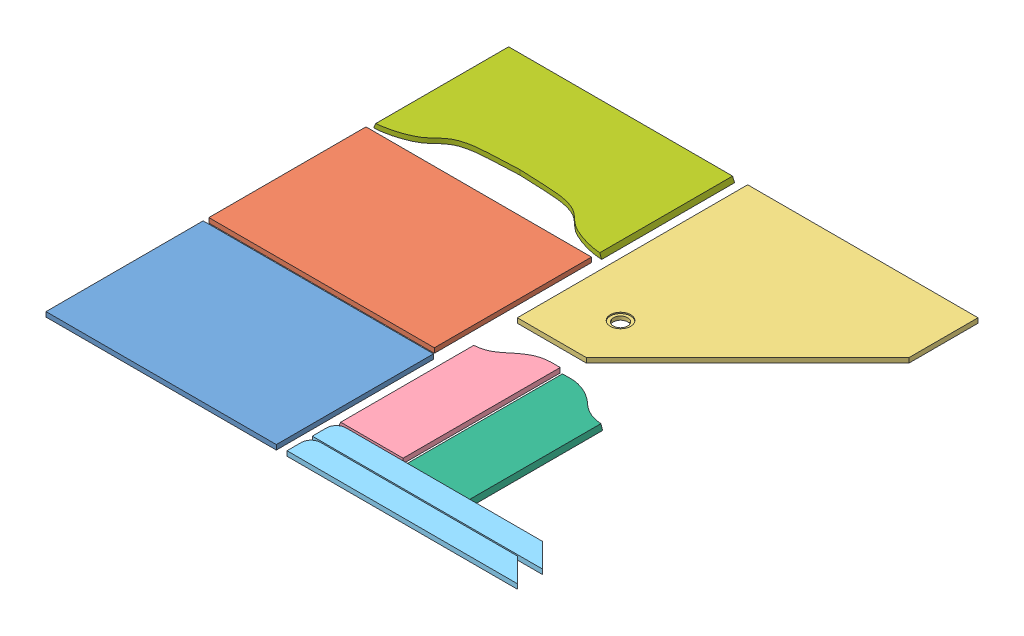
SolidWorks assembly Acrylic Layout.SLDASM, configuration Default (file format 10000). Lengths in mm.
Overall size (2502.34 1221.31 2438.4).
8 component instances, 7 part files, 19 mates.
Components (placement in the parent):
- 1-1: 1.sldprt [Default] at (1219.2 -25.4 -831.85) x (0 1 0) z (1 0 0) size (25.4 831.85 1219.2)
- 2-1: 2.sldprt [Default] at (-25.4 -1219.2 -1693.7836) x (1 0 0) z (0 -1 0) size (1193.8 831.85 25.4)
- 3-1: 3.sldprt [Default] at (1275.7043 0 -1219.2) size (1219.2 25.4 1219.2)
- 6-1: 6.sldprt [Default] at (1642.5311 -25.4 -272.8705) x (-1 0 0) z (0 -1 0) size (340.72 831.85 25.4)
- 7-1: 7.sldprt [Default] at (2494.9043 -857.25 -1352.9888) x (-1 0 0) z (0 0 -1) size (1219.2 25.4 127)
- 7-2: 7.sldprt [Default] at (2494.9043 -857.25 -1219.2) x (-1 0 0) z (0 0 -1) size (1219.2 25.4 127)
- 5-2: 5.sldprt [Default] at (2824.3383 1172.1773 -271.4125) x (0 -1 0) z (1 0 0) size (25.4 831.85 340.72)
- 4-2: 4.sldprt [Default] at (-258.8846 233.4867 -2438.4) x (0.707107 -0.707107 0) z (-0.707107 -0.707107 0) size (863.6 703.82 863.6)
Mates (geometry in assembly coordinates):
- Coincident4: coincident aligned: plane of 2-1 through (0 0 -861.9336) normal (0 1 0); plane of assembly through (0 0 0) normal (0 1 0)
- Coincident5: coincident aligned: plane of 1-1 through (1219.2 0 0) normal (0 1 0); plane of assembly through (0 0 0) normal (0 1 0)
- Coincident6: coincident aligned: plane of ? through (0 0 -1606.549) normal (0 1 0); plane of assembly through (0 0 0) normal (0 1 0)
- Coincident7: coincident aligned: plane of 3-1 through (1275.7043 0 -1219.2) normal (0 1 0); plane of assembly through (0 0 0) normal (0 1 0)
- Coincident8: coincident aligned: plane of ? through (1838.4986 0 -1096.5799) normal (0 1 0); plane of assembly through (0 0 0) normal (0 1 0)
- Coincident9: coincident aligned: plane of 6-1 through (1617.1311 0 -1104.7205) normal (0 1 0); plane of assembly through (0 0 0) normal (0 1 0)
- Coincident10: coincident aligned: plane of 7-1 through (1326.5043 0 -209.9888) normal (0 1 0); plane of assembly through (0 0 0) normal (0 1 0)
- Coincident11: coincident aligned: plane of 7-2 through (1326.5043 0 -76.2) normal (0 1 0); plane of assembly through (0 0 0) normal (0 1 0)
- Coincident12: coincident: point of 1-1; point of assembly
- Coincident13: coincident aligned: line of 2-1 through (0 0 -861.9336) axis (0 0 -1); line of assembly
- Coincident14: coincident: unknown of ?
- Coincident15: coincident: point of 3-1; point of assembly
- Coincident20: coincident: point of 7-2; point of assembly
- Coincident22: coincident aligned: plane of 4-2 through (10.5231 0 -1606.549) normal (0 1 0); plane of assembly through (0 0 0) normal (0 1 0)
- Coincident23: coincident aligned: line of 1-1 through (0 0 0) axis (0 0 -1); line of assembly
- Coincident25: coincident anti-aligned: line of 4-2 through (1195.9169 0 -2438.4) axis (-1 0 0); line of assembly
- Coincident28: coincident: point of 3-1; point of assembly
- Coincident29: coincident aligned: line of 7-2 through (1275.7043 0 0) axis (1 0 0); line of assembly
- Coincident30: coincident: point of 7-1; line of assembly
